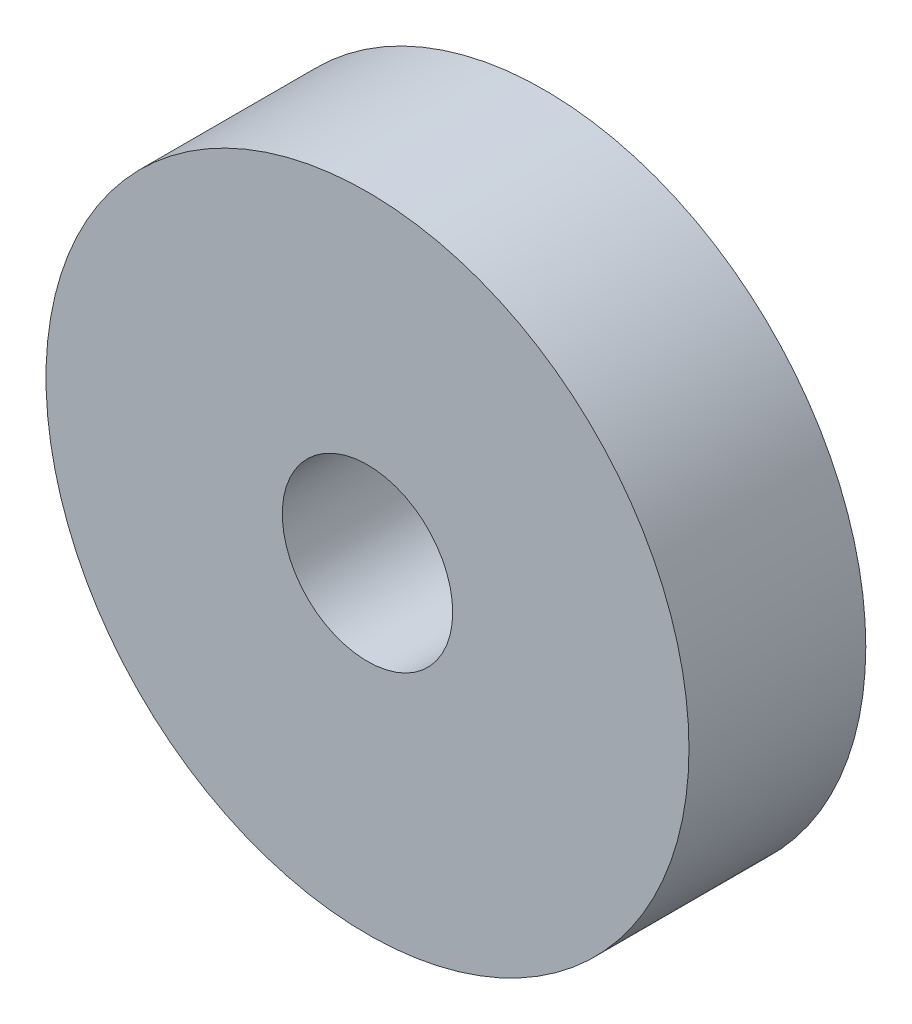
ISO-10303-21;
HEADER;
FILE_DESCRIPTION(('STEP AP214'),'2;1');
FILE_NAME('part.step','',(''),(''),'','','');
FILE_SCHEMA(('AUTOMOTIVE_DESIGN { 1 0 10303 214 1 1 1 1 }'));
ENDSEC;
DATA;
#1=APPLICATION_CONTEXT('core data for automotive mechanical design processes');
#2=APPLICATION_PROTOCOL_DEFINITION('international standard','automotive_design',2000,#1);
#3=PRODUCT_CONTEXT('',#1,'mechanical');
#4=PRODUCT('Part','Part','',(#3));
#5=PRODUCT_RELATED_PRODUCT_CATEGORY('part','',(#4));
#6=PRODUCT_DEFINITION_FORMATION('','',#4);
#7=PRODUCT_DEFINITION_CONTEXT('part definition',#1,'design');
#8=PRODUCT_DEFINITION('design','',#6,#7);
#9=PRODUCT_DEFINITION_SHAPE('','',#8);
#10=(LENGTH_UNIT() NAMED_UNIT(*) SI_UNIT(.MILLI.,.METRE.));
#11=(NAMED_UNIT(*) PLANE_ANGLE_UNIT() SI_UNIT($,.RADIAN.));
#12=(NAMED_UNIT(*) SI_UNIT($,.STERADIAN.) SOLID_ANGLE_UNIT());
#13=UNCERTAINTY_MEASURE_WITH_UNIT(LENGTH_MEASURE(1.E-05),#10,'distance_accuracy_value','');
#14=(GEOMETRIC_REPRESENTATION_CONTEXT(3) GLOBAL_UNCERTAINTY_ASSIGNED_CONTEXT((#13)) GLOBAL_UNIT_ASSIGNED_CONTEXT((#10,
#11,#12)) REPRESENTATION_CONTEXT('',''));
#15=CARTESIAN_POINT('',(0.,0.,0.));
#16=DIRECTION('',(0.,0.,1.));
#17=DIRECTION('',(1.,0.,0.));
#18=AXIS2_PLACEMENT_3D('',#15,#16,#17);
#19=CARTESIAN_POINT('',(0.,0.,55.));
#20=DIRECTION('',(0.,0.,1.));
#21=DIRECTION('',(1.,0.,0.));
#22=AXIS2_PLACEMENT_3D('',#19,#20,#21);
#23=PLANE('',#22);
#24=CARTESIAN_POINT('',(0.,0.,55.));
#25=DIRECTION('',(0.,0.,1.));
#26=DIRECTION('',(1.,0.,0.));
#27=AXIS2_PLACEMENT_3D('',#24,#25,#26);
#28=CIRCLE('',#27,100.);
#29=CARTESIAN_POINT('',(100.,0.,55.));
#30=VERTEX_POINT('',#29);
#31=EDGE_CURVE('E10',#30,#30,#28,.T.);
#32=ORIENTED_EDGE('',*,*,#31,.T.);
#33=EDGE_LOOP('',(#32));
#34=FACE_BOUND('',#33,.T.);
#35=CARTESIAN_POINT('',(0.,0.,55.));
#36=DIRECTION('',(0.,0.,1.));
#37=DIRECTION('',(1.,0.,0.));
#38=AXIS2_PLACEMENT_3D('',#35,#36,#37);
#39=CIRCLE('',#38,26.5);
#40=CARTESIAN_POINT('',(26.5,0.,55.));
#41=VERTEX_POINT('',#40);
#42=EDGE_CURVE('E50',#41,#41,#39,.T.);
#43=ORIENTED_EDGE('',*,*,#42,.F.);
#44=EDGE_LOOP('',(#43));
#45=FACE_BOUND('',#44,.T.);
#46=ADVANCED_FACE('F36',(#34,#45),#23,.T.);
#47=CARTESIAN_POINT('',(0.,0.,0.));
#48=DIRECTION('',(0.,0.,1.));
#49=DIRECTION('',(1.,0.,0.));
#50=AXIS2_PLACEMENT_3D('',#47,#48,#49);
#51=PLANE('',#50);
#52=CARTESIAN_POINT('',(0.,0.,0.));
#53=DIRECTION('',(0.,0.,1.));
#54=DIRECTION('',(1.,0.,0.));
#55=AXIS2_PLACEMENT_3D('',#52,#53,#54);
#56=CIRCLE('',#55,100.);
#57=CARTESIAN_POINT('',(100.,0.,0.));
#58=VERTEX_POINT('',#57);
#59=EDGE_CURVE('E40',#58,#58,#56,.T.);
#60=ORIENTED_EDGE('',*,*,#59,.F.);
#61=EDGE_LOOP('',(#60));
#62=FACE_BOUND('',#61,.T.);
#63=CARTESIAN_POINT('',(0.,0.,0.));
#64=DIRECTION('',(0.,0.,1.));
#65=DIRECTION('',(1.,0.,0.));
#66=AXIS2_PLACEMENT_3D('',#63,#64,#65);
#67=CIRCLE('',#66,26.5);
#68=CARTESIAN_POINT('',(26.5,0.,0.));
#69=VERTEX_POINT('',#68);
#70=EDGE_CURVE('E52',#69,#69,#67,.T.);
#71=ORIENTED_EDGE('',*,*,#70,.T.);
#72=EDGE_LOOP('',(#71));
#73=FACE_BOUND('',#72,.T.);
#74=ADVANCED_FACE('F63',(#62,#73),#51,.F.);
#75=CARTESIAN_POINT('',(0.,0.,55.));
#76=DIRECTION('',(0.,0.,-1.));
#77=DIRECTION('',(-1.,0.,0.));
#78=AXIS2_PLACEMENT_3D('',#75,#76,#77);
#79=CYLINDRICAL_SURFACE('',#78,100.);
#80=ORIENTED_EDGE('',*,*,#31,.F.);
#81=EDGE_LOOP('',(#80));
#82=FACE_BOUND('',#81,.T.);
#83=ORIENTED_EDGE('',*,*,#59,.T.);
#84=EDGE_LOOP('',(#83));
#85=FACE_BOUND('',#84,.T.);
#86=ADVANCED_FACE('F38',(#82,#85),#79,.T.);
#87=CARTESIAN_POINT('',(0.,0.,55.));
#88=DIRECTION('',(0.,0.,-1.));
#89=DIRECTION('',(-1.,0.,0.));
#90=AXIS2_PLACEMENT_3D('',#87,#88,#89);
#91=CYLINDRICAL_SURFACE('',#90,26.5);
#92=ORIENTED_EDGE('',*,*,#42,.T.);
#93=EDGE_LOOP('',(#92));
#94=FACE_BOUND('',#93,.T.);
#95=ORIENTED_EDGE('',*,*,#70,.F.);
#96=EDGE_LOOP('',(#95));
#97=FACE_BOUND('',#96,.T.);
#98=ADVANCED_FACE('F59',(#94,#97),#91,.F.);
#99=CLOSED_SHELL('',(#46,#74,#86,#98));
#100=MANIFOLD_SOLID_BREP('B2',#99);
#101=ADVANCED_BREP_SHAPE_REPRESENTATION('',(#18,#100),#14);
#102=SHAPE_DEFINITION_REPRESENTATION(#9,#101);
ENDSEC;
END-ISO-10303-21;
